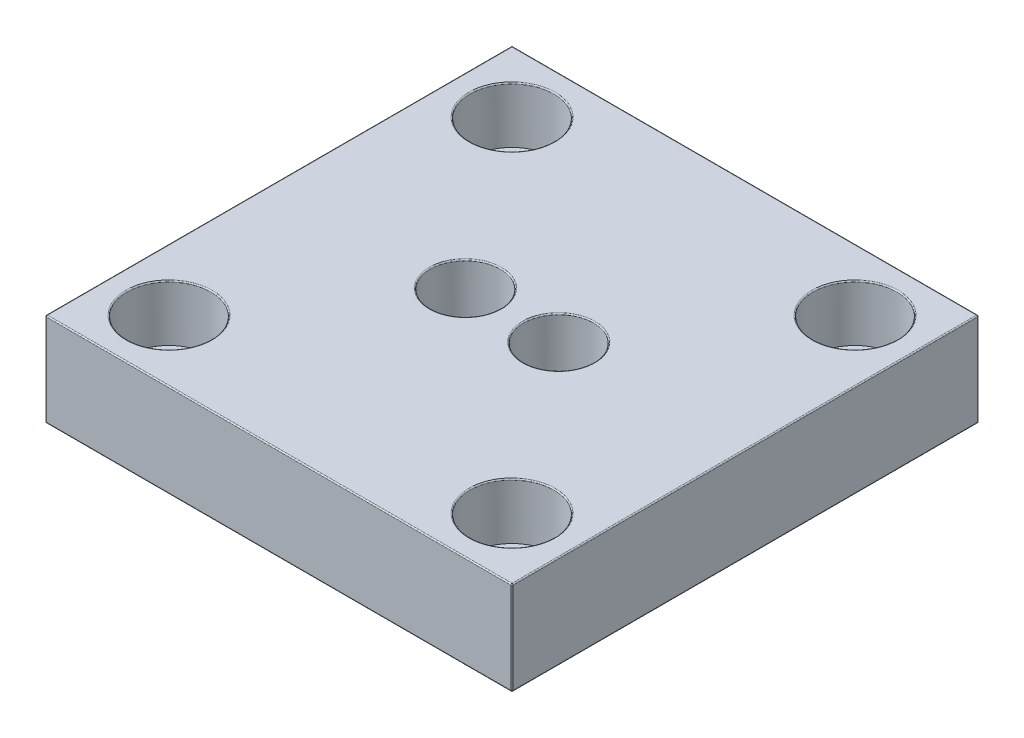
ISO-10303-21;
HEADER;
FILE_DESCRIPTION(('STEP AP214'),'2;1');
FILE_NAME('part.step','',(''),(''),'','','');
FILE_SCHEMA(('AUTOMOTIVE_DESIGN { 1 0 10303 214 1 1 1 1 }'));
ENDSEC;
DATA;
#1=APPLICATION_CONTEXT('core data for automotive mechanical design processes');
#2=APPLICATION_PROTOCOL_DEFINITION('international standard','automotive_design',2000,#1);
#3=PRODUCT_CONTEXT('',#1,'mechanical');
#4=PRODUCT('Part','Part','',(#3));
#5=PRODUCT_RELATED_PRODUCT_CATEGORY('part','',(#4));
#6=PRODUCT_DEFINITION_FORMATION('','',#4);
#7=PRODUCT_DEFINITION_CONTEXT('part definition',#1,'design');
#8=PRODUCT_DEFINITION('design','',#6,#7);
#9=PRODUCT_DEFINITION_SHAPE('','',#8);
#10=(LENGTH_UNIT() NAMED_UNIT(*) SI_UNIT(.MILLI.,.METRE.));
#11=(NAMED_UNIT(*) PLANE_ANGLE_UNIT() SI_UNIT($,.RADIAN.));
#12=(NAMED_UNIT(*) SI_UNIT($,.STERADIAN.) SOLID_ANGLE_UNIT());
#13=UNCERTAINTY_MEASURE_WITH_UNIT(LENGTH_MEASURE(1.E-05),#10,'distance_accuracy_value','');
#14=(GEOMETRIC_REPRESENTATION_CONTEXT(3) GLOBAL_UNCERTAINTY_ASSIGNED_CONTEXT((#13)) GLOBAL_UNIT_ASSIGNED_CONTEXT((#10,
#11,#12)) REPRESENTATION_CONTEXT('',''));
#15=CARTESIAN_POINT('',(0.,0.,0.));
#16=DIRECTION('',(0.,0.,1.));
#17=DIRECTION('',(1.,0.,0.));
#18=AXIS2_PLACEMENT_3D('',#15,#16,#17);
#19=CARTESIAN_POINT('',(86.75,0.,-13.25));
#20=DIRECTION('',(0.,1.,0.));
#21=DIRECTION('',(0.,0.,1.));
#22=AXIS2_PLACEMENT_3D('',#19,#20,#21);
#23=CYLINDRICAL_SURFACE('',#22,5.25);
#24=CARTESIAN_POINT('',(86.75,0.25,-13.25));
#25=DIRECTION('',(0.,-1.,0.));
#26=DIRECTION('',(0.,0.,-1.));
#27=AXIS2_PLACEMENT_3D('',#24,#25,#26);
#28=CIRCLE('',#27,5.25);
#29=CARTESIAN_POINT('',(86.75,0.25,-18.5));
#30=VERTEX_POINT('',#29);
#31=EDGE_CURVE('E226',#30,#30,#28,.T.);
#32=ORIENTED_EDGE('',*,*,#31,.T.);
#33=EDGE_LOOP('',(#32));
#34=FACE_BOUND('',#33,.T.);
#35=CARTESIAN_POINT('',(86.75,8.,-13.25));
#36=DIRECTION('',(0.,1.,0.));
#37=DIRECTION('',(0.,0.,1.));
#38=AXIS2_PLACEMENT_3D('',#35,#36,#37);
#39=CIRCLE('',#38,5.25);
#40=CARTESIAN_POINT('',(86.75,8.,-7.99999999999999));
#41=VERTEX_POINT('',#40);
#42=EDGE_CURVE('E182',#41,#41,#39,.F.);
#43=ORIENTED_EDGE('',*,*,#42,.F.);
#44=EDGE_LOOP('',(#43));
#45=FACE_BOUND('',#44,.T.);
#46=ADVANCED_FACE('F43',(#34,#45),#23,.F.);
#47=CARTESIAN_POINT('',(13.25,0.,-13.25));
#48=DIRECTION('',(0.,1.,0.));
#49=DIRECTION('',(0.,0.,1.));
#50=AXIS2_PLACEMENT_3D('',#47,#48,#49);
#51=CYLINDRICAL_SURFACE('',#50,5.25);
#52=CARTESIAN_POINT('',(13.25,0.25,-13.25));
#53=DIRECTION('',(0.,-1.,0.));
#54=DIRECTION('',(0.,0.,-1.));
#55=AXIS2_PLACEMENT_3D('',#52,#53,#54);
#56=CIRCLE('',#55,5.25);
#57=CARTESIAN_POINT('',(13.25,0.25,-18.5));
#58=VERTEX_POINT('',#57);
#59=EDGE_CURVE('E222',#58,#58,#56,.T.);
#60=ORIENTED_EDGE('',*,*,#59,.T.);
#61=EDGE_LOOP('',(#60));
#62=FACE_BOUND('',#61,.T.);
#63=CARTESIAN_POINT('',(13.25,8.,-13.25));
#64=DIRECTION('',(0.,1.,0.));
#65=DIRECTION('',(0.,0.,1.));
#66=AXIS2_PLACEMENT_3D('',#63,#64,#65);
#67=CIRCLE('',#66,5.25);
#68=CARTESIAN_POINT('',(13.25,8.,-8.));
#69=VERTEX_POINT('',#68);
#70=EDGE_CURVE('E433',#69,#69,#67,.F.);
#71=ORIENTED_EDGE('',*,*,#70,.F.);
#72=EDGE_LOOP('',(#71));
#73=FACE_BOUND('',#72,.T.);
#74=ADVANCED_FACE('F465',(#62,#73),#51,.F.);
#75=CARTESIAN_POINT('',(13.25,0.,-86.75));
#76=DIRECTION('',(0.,1.,0.));
#77=DIRECTION('',(0.,0.,1.));
#78=AXIS2_PLACEMENT_3D('',#75,#76,#77);
#79=CYLINDRICAL_SURFACE('',#78,5.25);
#80=CARTESIAN_POINT('',(13.25,0.25,-86.75));
#81=DIRECTION('',(0.,-1.,0.));
#82=DIRECTION('',(0.,0.,-1.));
#83=AXIS2_PLACEMENT_3D('',#80,#81,#82);
#84=CIRCLE('',#83,5.25);
#85=CARTESIAN_POINT('',(13.25,0.25,-92.));
#86=VERTEX_POINT('',#85);
#87=EDGE_CURVE('E218',#86,#86,#84,.T.);
#88=ORIENTED_EDGE('',*,*,#87,.T.);
#89=EDGE_LOOP('',(#88));
#90=FACE_BOUND('',#89,.T.);
#91=CARTESIAN_POINT('',(13.25,8.,-86.75));
#92=DIRECTION('',(0.,1.,0.));
#93=DIRECTION('',(0.,0.,1.));
#94=AXIS2_PLACEMENT_3D('',#91,#92,#93);
#95=CIRCLE('',#94,5.25);
#96=CARTESIAN_POINT('',(13.25,8.,-81.5));
#97=VERTEX_POINT('',#96);
#98=EDGE_CURVE('E438',#97,#97,#95,.F.);
#99=ORIENTED_EDGE('',*,*,#98,.F.);
#100=EDGE_LOOP('',(#99));
#101=FACE_BOUND('',#100,.T.);
#102=ADVANCED_FACE('F467',(#90,#101),#79,.F.);
#103=CARTESIAN_POINT('',(86.75,0.,-86.75));
#104=DIRECTION('',(0.,1.,0.));
#105=DIRECTION('',(0.,0.,1.));
#106=AXIS2_PLACEMENT_3D('',#103,#104,#105);
#107=CYLINDRICAL_SURFACE('',#106,5.25);
#108=CARTESIAN_POINT('',(86.75,0.25,-86.75));
#109=DIRECTION('',(0.,-1.,0.));
#110=DIRECTION('',(0.,0.,-1.));
#111=AXIS2_PLACEMENT_3D('',#108,#109,#110);
#112=CIRCLE('',#111,5.25);
#113=CARTESIAN_POINT('',(86.75,0.25,-92.));
#114=VERTEX_POINT('',#113);
#115=EDGE_CURVE('E234',#114,#114,#112,.T.);
#116=ORIENTED_EDGE('',*,*,#115,.T.);
#117=EDGE_LOOP('',(#116));
#118=FACE_BOUND('',#117,.T.);
#119=CARTESIAN_POINT('',(86.75,8.,-86.75));
#120=DIRECTION('',(0.,1.,0.));
#121=DIRECTION('',(0.,0.,1.));
#122=AXIS2_PLACEMENT_3D('',#119,#120,#121);
#123=CIRCLE('',#122,5.25);
#124=CARTESIAN_POINT('',(86.75,8.,-81.5));
#125=VERTEX_POINT('',#124);
#126=EDGE_CURVE('E442',#125,#125,#123,.F.);
#127=ORIENTED_EDGE('',*,*,#126,.F.);
#128=EDGE_LOOP('',(#127));
#129=FACE_BOUND('',#128,.T.);
#130=ADVANCED_FACE('F474',(#118,#129),#107,.F.);
#131=CARTESIAN_POINT('',(60.,0.,-50.));
#132=DIRECTION('',(0.,1.,0.));
#133=DIRECTION('',(0.,0.,1.));
#134=AXIS2_PLACEMENT_3D('',#131,#132,#133);
#135=CYLINDRICAL_SURFACE('',#134,4.50000000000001);
#136=CARTESIAN_POINT('',(60.,0.25,-50.));
#137=DIRECTION('',(0.,-1.,0.));
#138=DIRECTION('',(0.,0.,-1.));
#139=AXIS2_PLACEMENT_3D('',#136,#137,#138);
#140=CIRCLE('',#139,4.50000000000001);
#141=CARTESIAN_POINT('',(60.,0.25,-54.5));
#142=VERTEX_POINT('',#141);
#143=EDGE_CURVE('E230',#142,#142,#140,.T.);
#144=ORIENTED_EDGE('',*,*,#143,.T.);
#145=EDGE_LOOP('',(#144));
#146=FACE_BOUND('',#145,.T.);
#147=CARTESIAN_POINT('',(60.,8.,-50.));
#148=DIRECTION('',(0.,1.,0.));
#149=DIRECTION('',(0.,0.,1.));
#150=AXIS2_PLACEMENT_3D('',#147,#148,#149);
#151=CIRCLE('',#150,4.50000000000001);
#152=CARTESIAN_POINT('',(60.,8.,-45.5));
#153=VERTEX_POINT('',#152);
#154=EDGE_CURVE('E447',#153,#153,#151,.F.);
#155=ORIENTED_EDGE('',*,*,#154,.F.);
#156=EDGE_LOOP('',(#155));
#157=FACE_BOUND('',#156,.T.);
#158=ADVANCED_FACE('F485',(#146,#157),#135,.F.);
#159=CARTESIAN_POINT('',(40.,0.,-50.));
#160=DIRECTION('',(0.,1.,0.));
#161=DIRECTION('',(0.,0.,1.));
#162=AXIS2_PLACEMENT_3D('',#159,#160,#161);
#163=CYLINDRICAL_SURFACE('',#162,4.50000000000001);
#164=CARTESIAN_POINT('',(40.,0.25,-50.));
#165=DIRECTION('',(0.,-1.,0.));
#166=DIRECTION('',(0.,0.,-1.));
#167=AXIS2_PLACEMENT_3D('',#164,#165,#166);
#168=CIRCLE('',#167,4.50000000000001);
#169=CARTESIAN_POINT('',(40.,0.25,-54.5));
#170=VERTEX_POINT('',#169);
#171=EDGE_CURVE('E214',#170,#170,#168,.T.);
#172=ORIENTED_EDGE('',*,*,#171,.T.);
#173=EDGE_LOOP('',(#172));
#174=FACE_BOUND('',#173,.T.);
#175=CARTESIAN_POINT('',(40.,8.,-50.));
#176=DIRECTION('',(0.,1.,0.));
#177=DIRECTION('',(0.,0.,1.));
#178=AXIS2_PLACEMENT_3D('',#175,#176,#177);
#179=CIRCLE('',#178,4.50000000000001);
#180=CARTESIAN_POINT('',(40.,8.,-45.5));
#181=VERTEX_POINT('',#180);
#182=EDGE_CURVE('E173',#181,#181,#179,.F.);
#183=ORIENTED_EDGE('',*,*,#182,.F.);
#184=EDGE_LOOP('',(#183));
#185=FACE_BOUND('',#184,.T.);
#186=ADVANCED_FACE('F481',(#174,#185),#163,.F.);
#187=CARTESIAN_POINT('',(0.,20.,0.));
#188=DIRECTION('',(1.,0.,0.));
#189=DIRECTION('',(0.,0.,-1.));
#190=AXIS2_PLACEMENT_3D('',#187,#188,#189);
#191=PLANE('',#190);
#192=DIRECTION('',(0.,-1.,0.));
#193=VECTOR('',#192,1.);
#194=CARTESIAN_POINT('',(0.,20.,-99.75));
#195=LINE('',#194,#193);
#196=CARTESIAN_POINT('',(0.,19.75,-99.75));
#197=VERTEX_POINT('',#196);
#198=CARTESIAN_POINT('',(0.,0.25,-99.75));
#199=VERTEX_POINT('',#198);
#200=EDGE_CURVE('E244',#197,#199,#195,.T.);
#201=ORIENTED_EDGE('',*,*,#200,.T.);
#202=DIRECTION('',(0.,0.,1.));
#203=VECTOR('',#202,1.);
#204=CARTESIAN_POINT('',(0.,0.25,0.));
#205=LINE('',#204,#203);
#206=CARTESIAN_POINT('',(0.,0.25,-0.25));
#207=VERTEX_POINT('',#206);
#208=EDGE_CURVE('E247',#199,#207,#205,.T.);
#209=ORIENTED_EDGE('',*,*,#208,.T.);
#210=DIRECTION('',(0.,-1.,0.));
#211=VECTOR('',#210,1.);
#212=CARTESIAN_POINT('',(0.,20.,-0.25));
#213=LINE('',#212,#211);
#214=CARTESIAN_POINT('',(0.,19.75,-0.25));
#215=VERTEX_POINT('',#214);
#216=EDGE_CURVE('E241',#207,#215,#213,.F.);
#217=ORIENTED_EDGE('',*,*,#216,.T.);
#218=DIRECTION('',(0.,0.,1.));
#219=VECTOR('',#218,1.);
#220=CARTESIAN_POINT('',(0.,19.75,0.));
#221=LINE('',#220,#219);
#222=EDGE_CURVE('E238',#215,#197,#221,.F.);
#223=ORIENTED_EDGE('',*,*,#222,.T.);
#224=EDGE_LOOP('',(#201,#209,#217,#223));
#225=FACE_BOUND('',#224,.T.);
#226=ADVANCED_FACE('F484',(#225),#191,.F.);
#227=CARTESIAN_POINT('',(0.,20.,0.));
#228=DIRECTION('',(0.,0.,-1.));
#229=DIRECTION('',(-1.,0.,0.));
#230=AXIS2_PLACEMENT_3D('',#227,#228,#229);
#231=PLANE('',#230);
#232=DIRECTION('',(0.,-1.,0.));
#233=VECTOR('',#232,1.);
#234=CARTESIAN_POINT('',(0.25,20.,0.));
#235=LINE('',#234,#233);
#236=CARTESIAN_POINT('',(0.25,19.75,0.));
#237=VERTEX_POINT('',#236);
#238=CARTESIAN_POINT('',(0.25,0.25,0.));
#239=VERTEX_POINT('',#238);
#240=EDGE_CURVE('E282',#237,#239,#235,.T.);
#241=ORIENTED_EDGE('',*,*,#240,.T.);
#242=DIRECTION('',(1.,0.,0.));
#243=VECTOR('',#242,1.);
#244=CARTESIAN_POINT('',(100.,0.25,0.));
#245=LINE('',#244,#243);
#246=CARTESIAN_POINT('',(99.75,0.25,0.));
#247=VERTEX_POINT('',#246);
#248=EDGE_CURVE('E286',#239,#247,#245,.T.);
#249=ORIENTED_EDGE('',*,*,#248,.T.);
#250=DIRECTION('',(0.,-1.,0.));
#251=VECTOR('',#250,1.);
#252=CARTESIAN_POINT('',(99.75,20.,0.));
#253=LINE('',#252,#251);
#254=CARTESIAN_POINT('',(99.75,19.75,0.));
#255=VERTEX_POINT('',#254);
#256=EDGE_CURVE('E279',#247,#255,#253,.F.);
#257=ORIENTED_EDGE('',*,*,#256,.T.);
#258=DIRECTION('',(1.,0.,0.));
#259=VECTOR('',#258,1.);
#260=CARTESIAN_POINT('',(0.,19.75,0.));
#261=LINE('',#260,#259);
#262=EDGE_CURVE('E276',#255,#237,#261,.F.);
#263=ORIENTED_EDGE('',*,*,#262,.T.);
#264=EDGE_LOOP('',(#241,#249,#257,#263));
#265=FACE_BOUND('',#264,.T.);
#266=ADVANCED_FACE('F501',(#265),#231,.F.);
#267=CARTESIAN_POINT('',(100.,20.,0.));
#268=DIRECTION('',(-1.,0.,0.));
#269=DIRECTION('',(0.,0.,1.));
#270=AXIS2_PLACEMENT_3D('',#267,#268,#269);
#271=PLANE('',#270);
#272=DIRECTION('',(0.,0.,-1.));
#273=VECTOR('',#272,1.);
#274=CARTESIAN_POINT('',(100.,0.25,-100.));
#275=LINE('',#274,#273);
#276=CARTESIAN_POINT('',(100.,0.25,-0.25));
#277=VERTEX_POINT('',#276);
#278=CARTESIAN_POINT('',(100.,0.25,-99.75));
#279=VERTEX_POINT('',#278);
#280=EDGE_CURVE('E152',#277,#279,#275,.T.);
#281=ORIENTED_EDGE('',*,*,#280,.T.);
#282=DIRECTION('',(0.,-1.,0.));
#283=VECTOR('',#282,1.);
#284=CARTESIAN_POINT('',(100.,20.,-99.75));
#285=LINE('',#284,#283);
#286=CARTESIAN_POINT('',(100.,19.75,-99.75));
#287=VERTEX_POINT('',#286);
#288=EDGE_CURVE('E272',#279,#287,#285,.F.);
#289=ORIENTED_EDGE('',*,*,#288,.T.);
#290=DIRECTION('',(0.,0.,-1.));
#291=VECTOR('',#290,1.);
#292=CARTESIAN_POINT('',(100.,19.75,0.));
#293=LINE('',#292,#291);
#294=CARTESIAN_POINT('',(100.,19.75,-0.25));
#295=VERTEX_POINT('',#294);
#296=EDGE_CURVE('E264',#287,#295,#293,.F.);
#297=ORIENTED_EDGE('',*,*,#296,.T.);
#298=DIRECTION('',(0.,-1.,0.));
#299=VECTOR('',#298,1.);
#300=CARTESIAN_POINT('',(100.,20.,-0.25));
#301=LINE('',#300,#299);
#302=EDGE_CURVE('E267',#295,#277,#301,.T.);
#303=ORIENTED_EDGE('',*,*,#302,.T.);
#304=EDGE_LOOP('',(#281,#289,#297,#303));
#305=FACE_BOUND('',#304,.T.);
#306=ADVANCED_FACE('F497',(#305),#271,.F.);
#307=CARTESIAN_POINT('',(0.,20.,-100.));
#308=DIRECTION('',(0.,0.,1.));
#309=DIRECTION('',(1.,0.,0.));
#310=AXIS2_PLACEMENT_3D('',#307,#308,#309);
#311=PLANE('',#310);
#312=DIRECTION('',(-1.,0.,0.));
#313=VECTOR('',#312,1.);
#314=CARTESIAN_POINT('',(0.,0.25,-100.));
#315=LINE('',#314,#313);
#316=CARTESIAN_POINT('',(99.75,0.25,-100.));
#317=VERTEX_POINT('',#316);
#318=CARTESIAN_POINT('',(0.25,0.25,-100.));
#319=VERTEX_POINT('',#318);
#320=EDGE_CURVE('E257',#317,#319,#315,.T.);
#321=ORIENTED_EDGE('',*,*,#320,.T.);
#322=DIRECTION('',(0.,-1.,0.));
#323=VECTOR('',#322,1.);
#324=CARTESIAN_POINT('',(0.25,20.,-100.));
#325=LINE('',#324,#323);
#326=CARTESIAN_POINT('',(0.25,19.75,-100.));
#327=VERTEX_POINT('',#326);
#328=EDGE_CURVE('E260',#319,#327,#325,.F.);
#329=ORIENTED_EDGE('',*,*,#328,.T.);
#330=DIRECTION('',(-1.,0.,0.));
#331=VECTOR('',#330,1.);
#332=CARTESIAN_POINT('',(0.,19.75,-100.));
#333=LINE('',#332,#331);
#334=CARTESIAN_POINT('',(99.75,19.75,-100.));
#335=VERTEX_POINT('',#334);
#336=EDGE_CURVE('E251',#327,#335,#333,.F.);
#337=ORIENTED_EDGE('',*,*,#336,.T.);
#338=DIRECTION('',(0.,-1.,0.));
#339=VECTOR('',#338,1.);
#340=CARTESIAN_POINT('',(99.75,20.,-100.));
#341=LINE('',#340,#339);
#342=EDGE_CURVE('E254',#335,#317,#341,.T.);
#343=ORIENTED_EDGE('',*,*,#342,.T.);
#344=EDGE_LOOP('',(#321,#329,#337,#343));
#345=FACE_BOUND('',#344,.T.);
#346=ADVANCED_FACE('F490',(#345),#311,.F.);
#347=CARTESIAN_POINT('',(0.,20.,-100.));
#348=DIRECTION('',(0.,-1.,0.));
#349=DIRECTION('',(0.,0.,-1.));
#350=AXIS2_PLACEMENT_3D('',#347,#348,#349);
#351=PLANE('',#350);
#352=DIRECTION('',(0.,0.,-1.));
#353=VECTOR('',#352,1.);
#354=CARTESIAN_POINT('',(99.75,20.,-100.));
#355=LINE('',#354,#353);
#356=CARTESIAN_POINT('',(99.75,20.,-0.25));
#357=VERTEX_POINT('',#356);
#358=CARTESIAN_POINT('',(99.75,20.,-99.75));
#359=VERTEX_POINT('',#358);
#360=EDGE_CURVE('E61',#357,#359,#355,.T.);
#361=ORIENTED_EDGE('',*,*,#360,.T.);
#362=DIRECTION('',(-1.,0.,0.));
#363=VECTOR('',#362,1.);
#364=CARTESIAN_POINT('',(0.,20.,-99.75));
#365=LINE('',#364,#363);
#366=CARTESIAN_POINT('',(0.25,20.,-99.75));
#367=VERTEX_POINT('',#366);
#368=EDGE_CURVE('E320',#359,#367,#365,.T.);
#369=ORIENTED_EDGE('',*,*,#368,.T.);
#370=DIRECTION('',(0.,0.,1.));
#371=VECTOR('',#370,1.);
#372=CARTESIAN_POINT('',(0.25,20.,-100.));
#373=LINE('',#372,#371);
#374=CARTESIAN_POINT('',(0.25,20.,-0.25));
#375=VERTEX_POINT('',#374);
#376=EDGE_CURVE('E313',#367,#375,#373,.T.);
#377=ORIENTED_EDGE('',*,*,#376,.T.);
#378=DIRECTION('',(1.,0.,0.));
#379=VECTOR('',#378,1.);
#380=CARTESIAN_POINT('',(0.,20.,-0.25));
#381=LINE('',#380,#379);
#382=EDGE_CURVE('E66',#375,#357,#381,.T.);
#383=ORIENTED_EDGE('',*,*,#382,.T.);
#384=EDGE_LOOP('',(#361,#369,#377,#383));
#385=FACE_BOUND('',#384,.T.);
#386=CARTESIAN_POINT('',(40.,20.,-50.));
#387=DIRECTION('',(0.,-1.,0.));
#388=DIRECTION('',(0.,0.,-1.));
#389=AXIS2_PLACEMENT_3D('',#386,#387,#388);
#390=CIRCLE('',#389,7.75);
#391=CARTESIAN_POINT('',(40.,20.,-57.75));
#392=VERTEX_POINT('',#391);
#393=EDGE_CURVE('E309',#392,#392,#390,.T.);
#394=ORIENTED_EDGE('',*,*,#393,.T.);
#395=EDGE_LOOP('',(#394));
#396=FACE_BOUND('',#395,.T.);
#397=CARTESIAN_POINT('',(60.,20.,-50.));
#398=DIRECTION('',(0.,-1.,0.));
#399=DIRECTION('',(0.,0.,-1.));
#400=AXIS2_PLACEMENT_3D('',#397,#398,#399);
#401=CIRCLE('',#400,7.75);
#402=CARTESIAN_POINT('',(60.,20.,-57.75));
#403=VERTEX_POINT('',#402);
#404=EDGE_CURVE('E305',#403,#403,#401,.T.);
#405=ORIENTED_EDGE('',*,*,#404,.T.);
#406=EDGE_LOOP('',(#405));
#407=FACE_BOUND('',#406,.T.);
#408=CARTESIAN_POINT('',(86.75,20.,-86.75));
#409=DIRECTION('',(0.,-1.,0.));
#410=DIRECTION('',(0.,0.,-1.));
#411=AXIS2_PLACEMENT_3D('',#408,#409,#410);
#412=CIRCLE('',#411,9.24999999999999);
#413=CARTESIAN_POINT('',(86.75,20.,-96.));
#414=VERTEX_POINT('',#413);
#415=EDGE_CURVE('E301',#414,#414,#412,.T.);
#416=ORIENTED_EDGE('',*,*,#415,.T.);
#417=EDGE_LOOP('',(#416));
#418=FACE_BOUND('',#417,.T.);
#419=CARTESIAN_POINT('',(13.25,20.,-86.75));
#420=DIRECTION('',(0.,-1.,0.));
#421=DIRECTION('',(0.,0.,-1.));
#422=AXIS2_PLACEMENT_3D('',#419,#420,#421);
#423=CIRCLE('',#422,9.25000000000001);
#424=CARTESIAN_POINT('',(13.25,20.,-96.));
#425=VERTEX_POINT('',#424);
#426=EDGE_CURVE('E297',#425,#425,#423,.T.);
#427=ORIENTED_EDGE('',*,*,#426,.T.);
#428=EDGE_LOOP('',(#427));
#429=FACE_BOUND('',#428,.T.);
#430=CARTESIAN_POINT('',(13.25,20.,-13.25));
#431=DIRECTION('',(0.,-1.,0.));
#432=DIRECTION('',(0.,0.,-1.));
#433=AXIS2_PLACEMENT_3D('',#430,#431,#432);
#434=CIRCLE('',#433,9.25);
#435=CARTESIAN_POINT('',(13.25,20.,-22.5));
#436=VERTEX_POINT('',#435);
#437=EDGE_CURVE('E293',#436,#436,#434,.T.);
#438=ORIENTED_EDGE('',*,*,#437,.T.);
#439=EDGE_LOOP('',(#438));
#440=FACE_BOUND('',#439,.T.);
#441=CARTESIAN_POINT('',(86.75,20.,-13.25));
#442=DIRECTION('',(0.,-1.,0.));
#443=DIRECTION('',(0.,0.,-1.));
#444=AXIS2_PLACEMENT_3D('',#441,#442,#443);
#445=CIRCLE('',#444,9.25);
#446=CARTESIAN_POINT('',(86.75,20.,-22.5));
#447=VERTEX_POINT('',#446);
#448=EDGE_CURVE('E289',#447,#447,#445,.T.);
#449=ORIENTED_EDGE('',*,*,#448,.T.);
#450=EDGE_LOOP('',(#449));
#451=FACE_BOUND('',#450,.T.);
#452=ADVANCED_FACE('F487',(#385,#396,#407,#418,#429,#440,#451),#351,.F.);
#453=CARTESIAN_POINT('',(0.,0.,-100.));
#454=DIRECTION('',(0.,-1.,0.));
#455=DIRECTION('',(0.,0.,-1.));
#456=AXIS2_PLACEMENT_3D('',#453,#454,#455);
#457=PLANE('',#456);
#458=CARTESIAN_POINT('',(40.,0.,-50.));
#459=DIRECTION('',(0.,-1.,0.));
#460=DIRECTION('',(0.,0.,-1.));
#461=AXIS2_PLACEMENT_3D('',#458,#459,#460);
#462=CIRCLE('',#461,4.75000000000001);
#463=CARTESIAN_POINT('',(40.,0.,-54.75));
#464=VERTEX_POINT('',#463);
#465=EDGE_CURVE('E210',#464,#464,#462,.F.);
#466=ORIENTED_EDGE('',*,*,#465,.T.);
#467=EDGE_LOOP('',(#466));
#468=FACE_BOUND('',#467,.T.);
#469=CARTESIAN_POINT('',(13.25,0.,-86.75));
#470=DIRECTION('',(0.,-1.,0.));
#471=DIRECTION('',(0.,0.,-1.));
#472=AXIS2_PLACEMENT_3D('',#469,#470,#471);
#473=CIRCLE('',#472,5.5);
#474=CARTESIAN_POINT('',(13.25,0.,-92.25));
#475=VERTEX_POINT('',#474);
#476=EDGE_CURVE('E206',#475,#475,#473,.F.);
#477=ORIENTED_EDGE('',*,*,#476,.T.);
#478=EDGE_LOOP('',(#477));
#479=FACE_BOUND('',#478,.T.);
#480=CARTESIAN_POINT('',(13.25,0.,-13.25));
#481=DIRECTION('',(0.,-1.,0.));
#482=DIRECTION('',(0.,0.,-1.));
#483=AXIS2_PLACEMENT_3D('',#480,#481,#482);
#484=CIRCLE('',#483,5.5);
#485=CARTESIAN_POINT('',(13.25,0.,-18.75));
#486=VERTEX_POINT('',#485);
#487=EDGE_CURVE('E202',#486,#486,#484,.F.);
#488=ORIENTED_EDGE('',*,*,#487,.T.);
#489=EDGE_LOOP('',(#488));
#490=FACE_BOUND('',#489,.T.);
#491=CARTESIAN_POINT('',(86.75,0.,-13.25));
#492=DIRECTION('',(0.,-1.,0.));
#493=DIRECTION('',(0.,0.,-1.));
#494=AXIS2_PLACEMENT_3D('',#491,#492,#493);
#495=CIRCLE('',#494,5.5);
#496=CARTESIAN_POINT('',(86.75,0.,-18.75));
#497=VERTEX_POINT('',#496);
#498=EDGE_CURVE('E198',#497,#497,#495,.F.);
#499=ORIENTED_EDGE('',*,*,#498,.T.);
#500=EDGE_LOOP('',(#499));
#501=FACE_BOUND('',#500,.T.);
#502=CARTESIAN_POINT('',(60.,0.,-50.));
#503=DIRECTION('',(0.,-1.,0.));
#504=DIRECTION('',(0.,0.,-1.));
#505=AXIS2_PLACEMENT_3D('',#502,#503,#504);
#506=CIRCLE('',#505,4.75000000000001);
#507=CARTESIAN_POINT('',(60.,0.,-54.75));
#508=VERTEX_POINT('',#507);
#509=EDGE_CURVE('E194',#508,#508,#506,.F.);
#510=ORIENTED_EDGE('',*,*,#509,.T.);
#511=EDGE_LOOP('',(#510));
#512=FACE_BOUND('',#511,.T.);
#513=CARTESIAN_POINT('',(86.75,0.,-86.75));
#514=DIRECTION('',(0.,-1.,0.));
#515=DIRECTION('',(0.,0.,-1.));
#516=AXIS2_PLACEMENT_3D('',#513,#514,#515);
#517=CIRCLE('',#516,5.50000000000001);
#518=CARTESIAN_POINT('',(86.75,0.,-92.25));
#519=VERTEX_POINT('',#518);
#520=EDGE_CURVE('E190',#519,#519,#517,.F.);
#521=ORIENTED_EDGE('',*,*,#520,.T.);
#522=EDGE_LOOP('',(#521));
#523=FACE_BOUND('',#522,.T.);
#524=DIRECTION('',(1.,0.,0.));
#525=VECTOR('',#524,1.);
#526=CARTESIAN_POINT('',(0.,0.,-0.25));
#527=LINE('',#526,#525);
#528=CARTESIAN_POINT('',(99.75,0.,-0.25));
#529=VERTEX_POINT('',#528);
#530=CARTESIAN_POINT('',(0.25,0.,-0.25));
#531=VERTEX_POINT('',#530);
#532=EDGE_CURVE('E138',#529,#531,#527,.F.);
#533=ORIENTED_EDGE('',*,*,#532,.T.);
#534=DIRECTION('',(0.,0.,1.));
#535=VECTOR('',#534,1.);
#536=CARTESIAN_POINT('',(0.25,0.,-100.));
#537=LINE('',#536,#535);
#538=CARTESIAN_POINT('',(0.25,0.,-99.75));
#539=VERTEX_POINT('',#538);
#540=EDGE_CURVE('E187',#531,#539,#537,.F.);
#541=ORIENTED_EDGE('',*,*,#540,.T.);
#542=DIRECTION('',(-1.,0.,0.));
#543=VECTOR('',#542,1.);
#544=CARTESIAN_POINT('',(100.,0.,-99.75));
#545=LINE('',#544,#543);
#546=CARTESIAN_POINT('',(99.75,0.,-99.75));
#547=VERTEX_POINT('',#546);
#548=EDGE_CURVE('E141',#539,#547,#545,.F.);
#549=ORIENTED_EDGE('',*,*,#548,.T.);
#550=DIRECTION('',(0.,0.,-1.));
#551=VECTOR('',#550,1.);
#552=CARTESIAN_POINT('',(99.75,0.,0.));
#553=LINE('',#552,#551);
#554=EDGE_CURVE('E133',#547,#529,#553,.F.);
#555=ORIENTED_EDGE('',*,*,#554,.T.);
#556=EDGE_LOOP('',(#533,#541,#549,#555));
#557=FACE_BOUND('',#556,.T.);
#558=ADVANCED_FACE('F135',(#468,#479,#490,#501,#512,#523,#557),#457,.T.);
#559=CARTESIAN_POINT('',(40.,8.,-50.));
#560=DIRECTION('',(0.,1.,0.));
#561=DIRECTION('',(0.,0.,1.));
#562=AXIS2_PLACEMENT_3D('',#559,#560,#561);
#563=PLANE('',#562);
#564=CARTESIAN_POINT('',(40.,8.,-50.));
#565=DIRECTION('',(0.,1.,0.));
#566=DIRECTION('',(0.,0.,1.));
#567=AXIS2_PLACEMENT_3D('',#564,#565,#566);
#568=CIRCLE('',#567,7.5);
#569=CARTESIAN_POINT('',(40.,8.,-42.5));
#570=VERTEX_POINT('',#569);
#571=EDGE_CURVE('E179',#570,#570,#568,.T.);
#572=ORIENTED_EDGE('',*,*,#571,.T.);
#573=EDGE_LOOP('',(#572));
#574=FACE_BOUND('',#573,.T.);
#575=ORIENTED_EDGE('',*,*,#182,.T.);
#576=EDGE_LOOP('',(#575));
#577=FACE_BOUND('',#576,.T.);
#578=ADVANCED_FACE('F493',(#574,#577),#563,.T.);
#579=CARTESIAN_POINT('',(40.,8.,-50.));
#580=DIRECTION('',(0.,1.,0.));
#581=DIRECTION('',(0.,0.,1.));
#582=AXIS2_PLACEMENT_3D('',#579,#580,#581);
#583=CYLINDRICAL_SURFACE('',#582,7.5);
#584=CARTESIAN_POINT('',(40.,19.75,-50.));
#585=DIRECTION('',(0.,-1.,0.));
#586=DIRECTION('',(0.,0.,-1.));
#587=AXIS2_PLACEMENT_3D('',#584,#585,#586);
#588=CIRCLE('',#587,7.5);
#589=CARTESIAN_POINT('',(40.,19.75,-57.5));
#590=VERTEX_POINT('',#589);
#591=EDGE_CURVE('E322',#590,#590,#588,.F.);
#592=ORIENTED_EDGE('',*,*,#591,.T.);
#593=EDGE_LOOP('',(#592));
#594=FACE_BOUND('',#593,.T.);
#595=ORIENTED_EDGE('',*,*,#571,.F.);
#596=EDGE_LOOP('',(#595));
#597=FACE_BOUND('',#596,.T.);
#598=ADVANCED_FACE('F666',(#594,#597),#583,.F.);
#599=CARTESIAN_POINT('',(60.,8.,-50.));
#600=DIRECTION('',(0.,1.,0.));
#601=DIRECTION('',(0.,0.,1.));
#602=AXIS2_PLACEMENT_3D('',#599,#600,#601);
#603=PLANE('',#602);
#604=CARTESIAN_POINT('',(60.,8.,-50.));
#605=DIRECTION('',(0.,1.,0.));
#606=DIRECTION('',(0.,0.,1.));
#607=AXIS2_PLACEMENT_3D('',#604,#605,#606);
#608=CIRCLE('',#607,7.5);
#609=CARTESIAN_POINT('',(60.,8.,-42.5));
#610=VERTEX_POINT('',#609);
#611=EDGE_CURVE('E443',#610,#610,#608,.T.);
#612=ORIENTED_EDGE('',*,*,#611,.T.);
#613=EDGE_LOOP('',(#612));
#614=FACE_BOUND('',#613,.T.);
#615=ORIENTED_EDGE('',*,*,#154,.T.);
#616=EDGE_LOOP('',(#615));
#617=FACE_BOUND('',#616,.T.);
#618=ADVANCED_FACE('F663',(#614,#617),#603,.T.);
#619=CARTESIAN_POINT('',(60.,8.,-50.));
#620=DIRECTION('',(0.,1.,0.));
#621=DIRECTION('',(0.,0.,1.));
#622=AXIS2_PLACEMENT_3D('',#619,#620,#621);
#623=CYLINDRICAL_SURFACE('',#622,7.5);
#624=CARTESIAN_POINT('',(60.,19.75,-50.));
#625=DIRECTION('',(0.,-1.,0.));
#626=DIRECTION('',(0.,0.,-1.));
#627=AXIS2_PLACEMENT_3D('',#624,#625,#626);
#628=CIRCLE('',#627,7.5);
#629=CARTESIAN_POINT('',(60.,19.75,-57.5));
#630=VERTEX_POINT('',#629);
#631=EDGE_CURVE('E326',#630,#630,#628,.F.);
#632=ORIENTED_EDGE('',*,*,#631,.T.);
#633=EDGE_LOOP('',(#632));
#634=FACE_BOUND('',#633,.T.);
#635=ORIENTED_EDGE('',*,*,#611,.F.);
#636=EDGE_LOOP('',(#635));
#637=FACE_BOUND('',#636,.T.);
#638=ADVANCED_FACE('F658',(#634,#637),#623,.F.);
#639=CARTESIAN_POINT('',(86.75,8.,-86.75));
#640=DIRECTION('',(0.,1.,0.));
#641=DIRECTION('',(0.,0.,1.));
#642=AXIS2_PLACEMENT_3D('',#639,#640,#641);
#643=PLANE('',#642);
#644=CARTESIAN_POINT('',(86.75,8.,-86.75));
#645=DIRECTION('',(0.,1.,0.));
#646=DIRECTION('',(0.,0.,1.));
#647=AXIS2_PLACEMENT_3D('',#644,#645,#646);
#648=CIRCLE('',#647,8.99999999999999);
#649=CARTESIAN_POINT('',(86.75,8.,-77.75));
#650=VERTEX_POINT('',#649);
#651=EDGE_CURVE('E439',#650,#650,#648,.T.);
#652=ORIENTED_EDGE('',*,*,#651,.T.);
#653=EDGE_LOOP('',(#652));
#654=FACE_BOUND('',#653,.T.);
#655=ORIENTED_EDGE('',*,*,#126,.T.);
#656=EDGE_LOOP('',(#655));
#657=FACE_BOUND('',#656,.T.);
#658=ADVANCED_FACE('F655',(#654,#657),#643,.T.);
#659=CARTESIAN_POINT('',(86.75,8.,-86.75));
#660=DIRECTION('',(0.,1.,0.));
#661=DIRECTION('',(0.,0.,1.));
#662=AXIS2_PLACEMENT_3D('',#659,#660,#661);
#663=CYLINDRICAL_SURFACE('',#662,8.99999999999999);
#664=CARTESIAN_POINT('',(86.75,19.75,-86.75));
#665=DIRECTION('',(0.,-1.,0.));
#666=DIRECTION('',(0.,0.,-1.));
#667=AXIS2_PLACEMENT_3D('',#664,#665,#666);
#668=CIRCLE('',#667,8.99999999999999);
#669=CARTESIAN_POINT('',(86.75,19.75,-95.75));
#670=VERTEX_POINT('',#669);
#671=EDGE_CURVE('E330',#670,#670,#668,.F.);
#672=ORIENTED_EDGE('',*,*,#671,.T.);
#673=EDGE_LOOP('',(#672));
#674=FACE_BOUND('',#673,.T.);
#675=ORIENTED_EDGE('',*,*,#651,.F.);
#676=EDGE_LOOP('',(#675));
#677=FACE_BOUND('',#676,.T.);
#678=ADVANCED_FACE('F652',(#674,#677),#663,.F.);
#679=CARTESIAN_POINT('',(13.25,8.,-86.75));
#680=DIRECTION('',(0.,1.,0.));
#681=DIRECTION('',(0.,0.,1.));
#682=AXIS2_PLACEMENT_3D('',#679,#680,#681);
#683=PLANE('',#682);
#684=CARTESIAN_POINT('',(13.25,8.,-86.75));
#685=DIRECTION('',(0.,1.,0.));
#686=DIRECTION('',(0.,0.,1.));
#687=AXIS2_PLACEMENT_3D('',#684,#685,#686);
#688=CIRCLE('',#687,9.00000000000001);
#689=CARTESIAN_POINT('',(13.25,8.,-77.75));
#690=VERTEX_POINT('',#689);
#691=EDGE_CURVE('E434',#690,#690,#688,.T.);
#692=ORIENTED_EDGE('',*,*,#691,.T.);
#693=EDGE_LOOP('',(#692));
#694=FACE_BOUND('',#693,.T.);
#695=ORIENTED_EDGE('',*,*,#98,.T.);
#696=EDGE_LOOP('',(#695));
#697=FACE_BOUND('',#696,.T.);
#698=ADVANCED_FACE('F645',(#694,#697),#683,.T.);
#699=CARTESIAN_POINT('',(13.25,8.,-86.75));
#700=DIRECTION('',(0.,1.,0.));
#701=DIRECTION('',(0.,0.,1.));
#702=AXIS2_PLACEMENT_3D('',#699,#700,#701);
#703=CYLINDRICAL_SURFACE('',#702,9.00000000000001);
#704=CARTESIAN_POINT('',(13.25,19.75,-86.75));
#705=DIRECTION('',(0.,-1.,0.));
#706=DIRECTION('',(0.,0.,-1.));
#707=AXIS2_PLACEMENT_3D('',#704,#705,#706);
#708=CIRCLE('',#707,9.00000000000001);
#709=CARTESIAN_POINT('',(13.25,19.75,-95.75));
#710=VERTEX_POINT('',#709);
#711=EDGE_CURVE('E334',#710,#710,#708,.F.);
#712=ORIENTED_EDGE('',*,*,#711,.T.);
#713=EDGE_LOOP('',(#712));
#714=FACE_BOUND('',#713,.T.);
#715=ORIENTED_EDGE('',*,*,#691,.F.);
#716=EDGE_LOOP('',(#715));
#717=FACE_BOUND('',#716,.T.);
#718=ADVANCED_FACE('F640',(#714,#717),#703,.F.);
#719=CARTESIAN_POINT('',(13.25,8.,-13.25));
#720=DIRECTION('',(0.,1.,0.));
#721=DIRECTION('',(0.,0.,1.));
#722=AXIS2_PLACEMENT_3D('',#719,#720,#721);
#723=PLANE('',#722);
#724=CARTESIAN_POINT('',(13.25,8.,-13.25));
#725=DIRECTION('',(0.,1.,0.));
#726=DIRECTION('',(0.,0.,1.));
#727=AXIS2_PLACEMENT_3D('',#724,#725,#726);
#728=CIRCLE('',#727,9.);
#729=CARTESIAN_POINT('',(13.25,8.,-4.24999999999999));
#730=VERTEX_POINT('',#729);
#731=EDGE_CURVE('E428',#730,#730,#728,.T.);
#732=ORIENTED_EDGE('',*,*,#731,.T.);
#733=EDGE_LOOP('',(#732));
#734=FACE_BOUND('',#733,.T.);
#735=ORIENTED_EDGE('',*,*,#70,.T.);
#736=EDGE_LOOP('',(#735));
#737=FACE_BOUND('',#736,.T.);
#738=ADVANCED_FACE('F463',(#734,#737),#723,.T.);
#739=CARTESIAN_POINT('',(13.25,8.,-13.25));
#740=DIRECTION('',(0.,1.,0.));
#741=DIRECTION('',(0.,0.,1.));
#742=AXIS2_PLACEMENT_3D('',#739,#740,#741);
#743=CYLINDRICAL_SURFACE('',#742,9.);
#744=CARTESIAN_POINT('',(13.25,19.75,-13.25));
#745=DIRECTION('',(0.,-1.,0.));
#746=DIRECTION('',(0.,0.,-1.));
#747=AXIS2_PLACEMENT_3D('',#744,#745,#746);
#748=CIRCLE('',#747,9.);
#749=CARTESIAN_POINT('',(13.25,19.75,-22.25));
#750=VERTEX_POINT('',#749);
#751=EDGE_CURVE('E53',#750,#750,#748,.F.);
#752=ORIENTED_EDGE('',*,*,#751,.T.);
#753=EDGE_LOOP('',(#752));
#754=FACE_BOUND('',#753,.T.);
#755=ORIENTED_EDGE('',*,*,#731,.F.);
#756=EDGE_LOOP('',(#755));
#757=FACE_BOUND('',#756,.T.);
#758=ADVANCED_FACE('F632',(#754,#757),#743,.F.);
#759=CARTESIAN_POINT('',(86.75,8.,-13.25));
#760=DIRECTION('',(0.,1.,0.));
#761=DIRECTION('',(0.,0.,1.));
#762=AXIS2_PLACEMENT_3D('',#759,#760,#761);
#763=PLANE('',#762);
#764=CARTESIAN_POINT('',(86.75,8.,-13.25));
#765=DIRECTION('',(0.,1.,0.));
#766=DIRECTION('',(0.,0.,1.));
#767=AXIS2_PLACEMENT_3D('',#764,#765,#766);
#768=CIRCLE('',#767,9.);
#769=CARTESIAN_POINT('',(86.75,8.,-4.25));
#770=VERTEX_POINT('',#769);
#771=EDGE_CURVE('E415',#770,#770,#768,.T.);
#772=ORIENTED_EDGE('',*,*,#771,.T.);
#773=EDGE_LOOP('',(#772));
#774=FACE_BOUND('',#773,.T.);
#775=ORIENTED_EDGE('',*,*,#42,.T.);
#776=EDGE_LOOP('',(#775));
#777=FACE_BOUND('',#776,.T.);
#778=ADVANCED_FACE('F635',(#774,#777),#763,.T.);
#779=CARTESIAN_POINT('',(86.75,8.,-13.25));
#780=DIRECTION('',(0.,1.,0.));
#781=DIRECTION('',(0.,0.,1.));
#782=AXIS2_PLACEMENT_3D('',#779,#780,#781);
#783=CYLINDRICAL_SURFACE('',#782,9.);
#784=CARTESIAN_POINT('',(86.75,19.75,-13.25));
#785=DIRECTION('',(0.,-1.,0.));
#786=DIRECTION('',(0.,0.,-1.));
#787=AXIS2_PLACEMENT_3D('',#784,#785,#786);
#788=CIRCLE('',#787,9.);
#789=CARTESIAN_POINT('',(86.75,19.75,-22.25));
#790=VERTEX_POINT('',#789);
#791=EDGE_CURVE('E11',#790,#790,#788,.F.);
#792=ORIENTED_EDGE('',*,*,#791,.T.);
#793=EDGE_LOOP('',(#792));
#794=FACE_BOUND('',#793,.T.);
#795=ORIENTED_EDGE('',*,*,#771,.F.);
#796=EDGE_LOOP('',(#795));
#797=FACE_BOUND('',#796,.T.);
#798=ADVANCED_FACE('F513',(#794,#797),#783,.F.);
#799=CARTESIAN_POINT('',(40.,0.25,-50.));
#800=DIRECTION('',(0.,-1.,0.));
#801=DIRECTION('',(0.,0.,-1.));
#802=AXIS2_PLACEMENT_3D('',#799,#800,#801);
#803=TOROIDAL_SURFACE('',#802,4.75000000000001,0.25);
#804=ORIENTED_EDGE('',*,*,#171,.F.);
#805=EDGE_LOOP('',(#804));
#806=FACE_BOUND('',#805,.T.);
#807=ORIENTED_EDGE('',*,*,#465,.F.);
#808=EDGE_LOOP('',(#807));
#809=FACE_BOUND('',#808,.T.);
#810=ADVANCED_FACE('F509',(#806,#809),#803,.T.);
#811=CARTESIAN_POINT('',(13.25,0.25,-86.75));
#812=DIRECTION('',(0.,-1.,0.));
#813=DIRECTION('',(0.,0.,-1.));
#814=AXIS2_PLACEMENT_3D('',#811,#812,#813);
#815=TOROIDAL_SURFACE('',#814,5.5,0.25);
#816=ORIENTED_EDGE('',*,*,#87,.F.);
#817=EDGE_LOOP('',(#816));
#818=FACE_BOUND('',#817,.T.);
#819=ORIENTED_EDGE('',*,*,#476,.F.);
#820=EDGE_LOOP('',(#819));
#821=FACE_BOUND('',#820,.T.);
#822=ADVANCED_FACE('F512',(#818,#821),#815,.T.);
#823=CARTESIAN_POINT('',(13.25,0.25,-13.25));
#824=DIRECTION('',(0.,-1.,0.));
#825=DIRECTION('',(0.,0.,-1.));
#826=AXIS2_PLACEMENT_3D('',#823,#824,#825);
#827=TOROIDAL_SURFACE('',#826,5.5,0.25);
#828=ORIENTED_EDGE('',*,*,#59,.F.);
#829=EDGE_LOOP('',(#828));
#830=FACE_BOUND('',#829,.T.);
#831=ORIENTED_EDGE('',*,*,#487,.F.);
#832=EDGE_LOOP('',(#831));
#833=FACE_BOUND('',#832,.T.);
#834=ADVANCED_FACE('F517',(#830,#833),#827,.T.);
#835=CARTESIAN_POINT('',(86.75,0.25,-13.25));
#836=DIRECTION('',(0.,-1.,0.));
#837=DIRECTION('',(0.,0.,-1.));
#838=AXIS2_PLACEMENT_3D('',#835,#836,#837);
#839=TOROIDAL_SURFACE('',#838,5.5,0.25);
#840=ORIENTED_EDGE('',*,*,#31,.F.);
#841=EDGE_LOOP('',(#840));
#842=FACE_BOUND('',#841,.T.);
#843=ORIENTED_EDGE('',*,*,#498,.F.);
#844=EDGE_LOOP('',(#843));
#845=FACE_BOUND('',#844,.T.);
#846=ADVANCED_FACE('F521',(#842,#845),#839,.T.);
#847=CARTESIAN_POINT('',(60.,0.25,-50.));
#848=DIRECTION('',(0.,-1.,0.));
#849=DIRECTION('',(0.,0.,-1.));
#850=AXIS2_PLACEMENT_3D('',#847,#848,#849);
#851=TOROIDAL_SURFACE('',#850,4.75000000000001,0.25);
#852=ORIENTED_EDGE('',*,*,#143,.F.);
#853=EDGE_LOOP('',(#852));
#854=FACE_BOUND('',#853,.T.);
#855=ORIENTED_EDGE('',*,*,#509,.F.);
#856=EDGE_LOOP('',(#855));
#857=FACE_BOUND('',#856,.T.);
#858=ADVANCED_FACE('F525',(#854,#857),#851,.T.);
#859=CARTESIAN_POINT('',(86.75,0.25,-86.75));
#860=DIRECTION('',(0.,-1.,0.));
#861=DIRECTION('',(0.,0.,-1.));
#862=AXIS2_PLACEMENT_3D('',#859,#860,#861);
#863=TOROIDAL_SURFACE('',#862,5.50000000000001,0.25);
#864=ORIENTED_EDGE('',*,*,#115,.F.);
#865=EDGE_LOOP('',(#864));
#866=FACE_BOUND('',#865,.T.);
#867=ORIENTED_EDGE('',*,*,#520,.F.);
#868=EDGE_LOOP('',(#867));
#869=FACE_BOUND('',#868,.T.);
#870=ADVANCED_FACE('F529',(#866,#869),#863,.T.);
#871=CARTESIAN_POINT('',(99.75,19.75,-100.));
#872=DIRECTION('',(0.,0.,-1.));
#873=DIRECTION('',(-1.,0.,0.));
#874=AXIS2_PLACEMENT_3D('',#871,#872,#873);
#875=CYLINDRICAL_SURFACE('',#874,0.25);
#876=CARTESIAN_POINT('',(99.75,19.75,-99.75));
#877=DIRECTION('',(0.,0.,-1.));
#878=DIRECTION('',(-1.,0.,0.));
#879=AXIS2_PLACEMENT_3D('',#876,#877,#878);
#880=CIRCLE('',#879,0.25);
#881=EDGE_CURVE('E47',#359,#287,#880,.T.);
#882=ORIENTED_EDGE('',*,*,#881,.F.);
#883=ORIENTED_EDGE('',*,*,#360,.F.);
#884=CARTESIAN_POINT('',(99.75,19.75,-0.25));
#885=DIRECTION('',(0.,0.,1.));
#886=DIRECTION('',(0.,-1.,0.));
#887=AXIS2_PLACEMENT_3D('',#884,#885,#886);
#888=CIRCLE('',#887,0.25);
#889=EDGE_CURVE('E406',#295,#357,#888,.T.);
#890=ORIENTED_EDGE('',*,*,#889,.F.);
#891=ORIENTED_EDGE('',*,*,#296,.F.);
#892=EDGE_LOOP('',(#882,#883,#890,#891));
#893=FACE_BOUND('',#892,.T.);
#894=ADVANCED_FACE('F533',(#893),#875,.T.);
#895=CARTESIAN_POINT('',(99.75,19.75,-99.75));
#896=DIRECTION('',(0.,0.,1.));
#897=DIRECTION('',(1.,0.,0.));
#898=AXIS2_PLACEMENT_3D('',#895,#896,#897);
#899=SPHERICAL_SURFACE('',#898,0.25);
#900=CARTESIAN_POINT('',(99.75,19.75,-99.75));
#901=DIRECTION('',(1.,0.,0.));
#902=DIRECTION('',(0.,0.,-1.));
#903=AXIS2_PLACEMENT_3D('',#900,#901,#902);
#904=CIRCLE('',#903,0.25);
#905=EDGE_CURVE('E400',#359,#335,#904,.F.);
#906=ORIENTED_EDGE('',*,*,#905,.F.);
#907=ORIENTED_EDGE('',*,*,#881,.T.);
#908=CARTESIAN_POINT('',(99.75,19.75,-99.75));
#909=DIRECTION('',(0.,1.,0.));
#910=DIRECTION('',(0.,0.,1.));
#911=AXIS2_PLACEMENT_3D('',#908,#909,#910);
#912=CIRCLE('',#911,0.25);
#913=EDGE_CURVE('E404',#335,#287,#912,.F.);
#914=ORIENTED_EDGE('',*,*,#913,.F.);
#915=EDGE_LOOP('',(#906,#907,#914));
#916=FACE_BOUND('',#915,.T.);
#917=ADVANCED_FACE('F601',(#916),#899,.T.);
#918=CARTESIAN_POINT('',(99.75,19.75,-0.25));
#919=DIRECTION('',(0.,0.,1.));
#920=DIRECTION('',(1.,0.,0.));
#921=AXIS2_PLACEMENT_3D('',#918,#919,#920);
#922=SPHERICAL_SURFACE('',#921,0.25);
#923=CARTESIAN_POINT('',(99.75,19.75,-0.25));
#924=DIRECTION('',(0.,1.,0.));
#925=DIRECTION('',(0.,0.,1.));
#926=AXIS2_PLACEMENT_3D('',#923,#924,#925);
#927=CIRCLE('',#926,0.25);
#928=EDGE_CURVE('E392',#295,#255,#927,.F.);
#929=ORIENTED_EDGE('',*,*,#928,.F.);
#930=ORIENTED_EDGE('',*,*,#889,.T.);
#931=CARTESIAN_POINT('',(99.75,19.75,-0.25));
#932=DIRECTION('',(1.,0.,0.));
#933=DIRECTION('',(0.,0.,-1.));
#934=AXIS2_PLACEMENT_3D('',#931,#932,#933);
#935=CIRCLE('',#934,0.25);
#936=EDGE_CURVE('E396',#255,#357,#935,.F.);
#937=ORIENTED_EDGE('',*,*,#936,.F.);
#938=EDGE_LOOP('',(#929,#930,#937));
#939=FACE_BOUND('',#938,.T.);
#940=ADVANCED_FACE('F597',(#939),#922,.T.);
#941=CARTESIAN_POINT('',(99.75,20.,-99.75));
#942=DIRECTION('',(0.,-1.,0.));
#943=DIRECTION('',(0.,0.,-1.));
#944=AXIS2_PLACEMENT_3D('',#941,#942,#943);
#945=CYLINDRICAL_SURFACE('',#944,0.25);
#946=ORIENTED_EDGE('',*,*,#913,.T.);
#947=ORIENTED_EDGE('',*,*,#288,.F.);
#948=CARTESIAN_POINT('',(99.75,0.25,-99.75));
#949=DIRECTION('',(0.,-1.,0.));
#950=DIRECTION('',(0.,0.,-1.));
#951=AXIS2_PLACEMENT_3D('',#948,#949,#950);
#952=CIRCLE('',#951,0.25);
#953=EDGE_CURVE('E385',#317,#279,#952,.T.);
#954=ORIENTED_EDGE('',*,*,#953,.F.);
#955=ORIENTED_EDGE('',*,*,#342,.F.);
#956=EDGE_LOOP('',(#946,#947,#954,#955));
#957=FACE_BOUND('',#956,.T.);
#958=ADVANCED_FACE('F593',(#957),#945,.T.);
#959=CARTESIAN_POINT('',(0.,19.75,-99.75));
#960=DIRECTION('',(-1.,0.,0.));
#961=DIRECTION('',(0.,0.,1.));
#962=AXIS2_PLACEMENT_3D('',#959,#960,#961);
#963=CYLINDRICAL_SURFACE('',#962,0.25);
#964=ORIENTED_EDGE('',*,*,#905,.T.);
#965=ORIENTED_EDGE('',*,*,#336,.F.);
#966=CARTESIAN_POINT('',(0.25,19.75,-99.75));
#967=DIRECTION('',(-1.,0.,0.));
#968=DIRECTION('',(0.,0.,1.));
#969=AXIS2_PLACEMENT_3D('',#966,#967,#968);
#970=CIRCLE('',#969,0.25);
#971=EDGE_CURVE('E381',#367,#327,#970,.T.);
#972=ORIENTED_EDGE('',*,*,#971,.F.);
#973=ORIENTED_EDGE('',*,*,#368,.F.);
#974=EDGE_LOOP('',(#964,#965,#972,#973));
#975=FACE_BOUND('',#974,.T.);
#976=ADVANCED_FACE('F589',(#975),#963,.T.);
#977=CARTESIAN_POINT('',(0.25,19.75,-100.));
#978=DIRECTION('',(0.,0.,1.));
#979=DIRECTION('',(1.,0.,0.));
#980=AXIS2_PLACEMENT_3D('',#977,#978,#979);
#981=CYLINDRICAL_SURFACE('',#980,0.25);
#982=CARTESIAN_POINT('',(0.25,19.75,-0.25));
#983=DIRECTION('',(0.,0.,1.));
#984=DIRECTION('',(1.,0.,0.));
#985=AXIS2_PLACEMENT_3D('',#982,#983,#984);
#986=CIRCLE('',#985,0.25);
#987=EDGE_CURVE('E374',#375,#215,#986,.T.);
#988=ORIENTED_EDGE('',*,*,#987,.F.);
#989=ORIENTED_EDGE('',*,*,#376,.F.);
#990=CARTESIAN_POINT('',(0.25,19.75,-99.75));
#991=DIRECTION('',(0.,0.,-1.));
#992=DIRECTION('',(-1.,0.,0.));
#993=AXIS2_PLACEMENT_3D('',#990,#991,#992);
#994=CIRCLE('',#993,0.25);
#995=EDGE_CURVE('E378',#197,#367,#994,.T.);
#996=ORIENTED_EDGE('',*,*,#995,.F.);
#997=ORIENTED_EDGE('',*,*,#222,.F.);
#998=EDGE_LOOP('',(#988,#989,#996,#997));
#999=FACE_BOUND('',#998,.T.);
#1000=ADVANCED_FACE('F585',(#999),#981,.T.);
#1001=CARTESIAN_POINT('',(0.,19.75,-0.25));
#1002=DIRECTION('',(1.,0.,0.));
#1003=DIRECTION('',(0.,0.,-1.));
#1004=AXIS2_PLACEMENT_3D('',#1001,#1002,#1003);
#1005=CYLINDRICAL_SURFACE('',#1004,0.25);
#1006=ORIENTED_EDGE('',*,*,#936,.T.);
#1007=ORIENTED_EDGE('',*,*,#382,.F.);
#1008=CARTESIAN_POINT('',(0.25,19.75,-0.25));
#1009=DIRECTION('',(-1.,0.,0.));
#1010=DIRECTION('',(0.,0.,1.));
#1011=AXIS2_PLACEMENT_3D('',#1008,#1009,#1010);
#1012=CIRCLE('',#1011,0.25);
#1013=EDGE_CURVE('E370',#237,#375,#1012,.T.);
#1014=ORIENTED_EDGE('',*,*,#1013,.F.);
#1015=ORIENTED_EDGE('',*,*,#262,.F.);
#1016=EDGE_LOOP('',(#1006,#1007,#1014,#1015));
#1017=FACE_BOUND('',#1016,.T.);
#1018=ADVANCED_FACE('F581',(#1017),#1005,.T.);
#1019=CARTESIAN_POINT('',(99.75,20.,-0.25));
#1020=DIRECTION('',(0.,-1.,0.));
#1021=DIRECTION('',(0.,0.,-1.));
#1022=AXIS2_PLACEMENT_3D('',#1019,#1020,#1021);
#1023=CYLINDRICAL_SURFACE('',#1022,0.25);
#1024=ORIENTED_EDGE('',*,*,#928,.T.);
#1025=ORIENTED_EDGE('',*,*,#256,.F.);
#1026=CARTESIAN_POINT('',(99.75,0.25,-0.25));
#1027=DIRECTION('',(0.,-1.,0.));
#1028=DIRECTION('',(0.,0.,-1.));
#1029=AXIS2_PLACEMENT_3D('',#1026,#1027,#1028);
#1030=CIRCLE('',#1029,0.25);
#1031=EDGE_CURVE('E157',#277,#247,#1030,.T.);
#1032=ORIENTED_EDGE('',*,*,#1031,.F.);
#1033=ORIENTED_EDGE('',*,*,#302,.F.);
#1034=EDGE_LOOP('',(#1024,#1025,#1032,#1033));
#1035=FACE_BOUND('',#1034,.T.);
#1036=ADVANCED_FACE('F578',(#1035),#1023,.T.);
#1037=CARTESIAN_POINT('',(99.75,0.25,0.));
#1038=DIRECTION('',(0.,0.,1.));
#1039=DIRECTION('',(1.,0.,0.));
#1040=AXIS2_PLACEMENT_3D('',#1037,#1038,#1039);
#1041=CYLINDRICAL_SURFACE('',#1040,0.25);
#1042=CARTESIAN_POINT('',(99.75,0.25,-99.75));
#1043=DIRECTION('',(0.,0.,-1.));
#1044=DIRECTION('',(-1.,0.,0.));
#1045=AXIS2_PLACEMENT_3D('',#1042,#1043,#1044);
#1046=CIRCLE('',#1045,0.25);
#1047=EDGE_CURVE('E389',#279,#547,#1046,.T.);
#1048=ORIENTED_EDGE('',*,*,#1047,.F.);
#1049=ORIENTED_EDGE('',*,*,#280,.F.);
#1050=CARTESIAN_POINT('',(99.75,0.25,-0.25));
#1051=DIRECTION('',(0.,0.,1.));
#1052=DIRECTION('',(1.,0.,0.));
#1053=AXIS2_PLACEMENT_3D('',#1050,#1051,#1052);
#1054=CIRCLE('',#1053,0.25);
#1055=EDGE_CURVE('E149',#529,#277,#1054,.T.);
#1056=ORIENTED_EDGE('',*,*,#1055,.F.);
#1057=ORIENTED_EDGE('',*,*,#554,.F.);
#1058=EDGE_LOOP('',(#1048,#1049,#1056,#1057));
#1059=FACE_BOUND('',#1058,.T.);
#1060=ADVANCED_FACE('F151',(#1059),#1041,.T.);
#1061=CARTESIAN_POINT('',(99.75,0.25,-99.75));
#1062=DIRECTION('',(0.,0.,1.));
#1063=DIRECTION('',(1.,0.,0.));
#1064=AXIS2_PLACEMENT_3D('',#1061,#1062,#1063);
#1065=SPHERICAL_SURFACE('',#1064,0.25);
#1066=ORIENTED_EDGE('',*,*,#953,.T.);
#1067=ORIENTED_EDGE('',*,*,#1047,.T.);
#1068=CARTESIAN_POINT('',(99.75,0.25,-99.75));
#1069=DIRECTION('',(1.,0.,0.));
#1070=DIRECTION('',(0.,0.,-1.));
#1071=AXIS2_PLACEMENT_3D('',#1068,#1069,#1070);
#1072=CIRCLE('',#1071,0.25);
#1073=EDGE_CURVE('E158',#317,#547,#1072,.F.);
#1074=ORIENTED_EDGE('',*,*,#1073,.F.);
#1075=EDGE_LOOP('',(#1066,#1067,#1074));
#1076=FACE_BOUND('',#1075,.T.);
#1077=ADVANCED_FACE('F571',(#1076),#1065,.T.);
#1078=CARTESIAN_POINT('',(0.25,19.75,-99.75));
#1079=DIRECTION('',(0.,0.,1.));
#1080=DIRECTION('',(1.,0.,0.));
#1081=AXIS2_PLACEMENT_3D('',#1078,#1079,#1080);
#1082=SPHERICAL_SURFACE('',#1081,0.25);
#1083=ORIENTED_EDGE('',*,*,#995,.T.);
#1084=ORIENTED_EDGE('',*,*,#971,.T.);
#1085=CARTESIAN_POINT('',(0.25,19.75,-99.75));
#1086=DIRECTION('',(0.,1.,0.));
#1087=DIRECTION('',(0.,0.,1.));
#1088=AXIS2_PLACEMENT_3D('',#1085,#1086,#1087);
#1089=CIRCLE('',#1088,0.25);
#1090=EDGE_CURVE('E363',#197,#327,#1089,.F.);
#1091=ORIENTED_EDGE('',*,*,#1090,.F.);
#1092=EDGE_LOOP('',(#1083,#1084,#1091));
#1093=FACE_BOUND('',#1092,.T.);
#1094=ADVANCED_FACE('F567',(#1093),#1082,.T.);
#1095=CARTESIAN_POINT('',(0.25,19.75,-0.25));
#1096=DIRECTION('',(0.,0.,1.));
#1097=DIRECTION('',(1.,0.,0.));
#1098=AXIS2_PLACEMENT_3D('',#1095,#1096,#1097);
#1099=SPHERICAL_SURFACE('',#1098,0.25);
#1100=ORIENTED_EDGE('',*,*,#1013,.T.);
#1101=ORIENTED_EDGE('',*,*,#987,.T.);
#1102=CARTESIAN_POINT('',(0.25,19.75,-0.25));
#1103=DIRECTION('',(0.,1.,0.));
#1104=DIRECTION('',(0.,0.,1.));
#1105=AXIS2_PLACEMENT_3D('',#1102,#1103,#1104);
#1106=CIRCLE('',#1105,0.25);
#1107=EDGE_CURVE('E166',#237,#215,#1106,.F.);
#1108=ORIENTED_EDGE('',*,*,#1107,.F.);
#1109=EDGE_LOOP('',(#1100,#1101,#1108));
#1110=FACE_BOUND('',#1109,.T.);
#1111=ADVANCED_FACE('F564',(#1110),#1099,.T.);
#1112=CARTESIAN_POINT('',(99.75,0.25,-0.25));
#1113=DIRECTION('',(0.,0.,1.));
#1114=DIRECTION('',(1.,0.,0.));
#1115=AXIS2_PLACEMENT_3D('',#1112,#1113,#1114);
#1116=SPHERICAL_SURFACE('',#1115,0.25);
#1117=ORIENTED_EDGE('',*,*,#1055,.T.);
#1118=ORIENTED_EDGE('',*,*,#1031,.T.);
#1119=CARTESIAN_POINT('',(99.75,0.25,-0.25));
#1120=DIRECTION('',(1.,0.,0.));
#1121=DIRECTION('',(0.,0.,-1.));
#1122=AXIS2_PLACEMENT_3D('',#1119,#1120,#1121);
#1123=CIRCLE('',#1122,0.25);
#1124=EDGE_CURVE('E161',#529,#247,#1123,.F.);
#1125=ORIENTED_EDGE('',*,*,#1124,.F.);
#1126=EDGE_LOOP('',(#1117,#1118,#1125));
#1127=FACE_BOUND('',#1126,.T.);
#1128=ADVANCED_FACE('F162',(#1127),#1116,.T.);
#1129=CARTESIAN_POINT('',(0.,0.25,-99.75));
#1130=DIRECTION('',(1.,0.,0.));
#1131=DIRECTION('',(0.,0.,-1.));
#1132=AXIS2_PLACEMENT_3D('',#1129,#1130,#1131);
#1133=CYLINDRICAL_SURFACE('',#1132,0.25);
#1134=ORIENTED_EDGE('',*,*,#1073,.T.);
#1135=ORIENTED_EDGE('',*,*,#548,.F.);
#1136=CARTESIAN_POINT('',(0.25,0.25,-99.75));
#1137=DIRECTION('',(-1.,0.,0.));
#1138=DIRECTION('',(0.,0.,1.));
#1139=AXIS2_PLACEMENT_3D('',#1136,#1137,#1138);
#1140=CIRCLE('',#1139,0.25);
#1141=EDGE_CURVE('E167',#319,#539,#1140,.T.);
#1142=ORIENTED_EDGE('',*,*,#1141,.F.);
#1143=ORIENTED_EDGE('',*,*,#320,.F.);
#1144=EDGE_LOOP('',(#1134,#1135,#1142,#1143));
#1145=FACE_BOUND('',#1144,.T.);
#1146=ADVANCED_FACE('F557',(#1145),#1133,.T.);
#1147=CARTESIAN_POINT('',(0.25,20.,-99.75));
#1148=DIRECTION('',(0.,-1.,0.));
#1149=DIRECTION('',(0.,0.,-1.));
#1150=AXIS2_PLACEMENT_3D('',#1147,#1148,#1149);
#1151=CYLINDRICAL_SURFACE('',#1150,0.25);
#1152=ORIENTED_EDGE('',*,*,#1090,.T.);
#1153=ORIENTED_EDGE('',*,*,#328,.F.);
#1154=CARTESIAN_POINT('',(0.25,0.25,-99.75));
#1155=DIRECTION('',(0.,-1.,0.));
#1156=DIRECTION('',(0.,0.,-1.));
#1157=AXIS2_PLACEMENT_3D('',#1154,#1155,#1156);
#1158=CIRCLE('',#1157,0.25);
#1159=EDGE_CURVE('E353',#199,#319,#1158,.T.);
#1160=ORIENTED_EDGE('',*,*,#1159,.F.);
#1161=ORIENTED_EDGE('',*,*,#200,.F.);
#1162=EDGE_LOOP('',(#1152,#1153,#1160,#1161));
#1163=FACE_BOUND('',#1162,.T.);
#1164=ADVANCED_FACE('F553',(#1163),#1151,.T.);
#1165=CARTESIAN_POINT('',(0.25,20.,-0.25));
#1166=DIRECTION('',(0.,-1.,0.));
#1167=DIRECTION('',(0.,0.,-1.));
#1168=AXIS2_PLACEMENT_3D('',#1165,#1166,#1167);
#1169=CYLINDRICAL_SURFACE('',#1168,0.25);
#1170=ORIENTED_EDGE('',*,*,#1107,.T.);
#1171=ORIENTED_EDGE('',*,*,#216,.F.);
#1172=CARTESIAN_POINT('',(0.25,0.25,-0.25));
#1173=DIRECTION('',(0.,-1.,0.));
#1174=DIRECTION('',(0.,0.,-1.));
#1175=AXIS2_PLACEMENT_3D('',#1172,#1173,#1174);
#1176=CIRCLE('',#1175,0.25);
#1177=EDGE_CURVE('E349',#239,#207,#1176,.T.);
#1178=ORIENTED_EDGE('',*,*,#1177,.F.);
#1179=ORIENTED_EDGE('',*,*,#240,.F.);
#1180=EDGE_LOOP('',(#1170,#1171,#1178,#1179));
#1181=FACE_BOUND('',#1180,.T.);
#1182=ADVANCED_FACE('F550',(#1181),#1169,.T.);
#1183=CARTESIAN_POINT('',(0.,0.25,-0.25));
#1184=DIRECTION('',(-1.,0.,0.));
#1185=DIRECTION('',(0.,0.,1.));
#1186=AXIS2_PLACEMENT_3D('',#1183,#1184,#1185);
#1187=CYLINDRICAL_SURFACE('',#1186,0.25);
#1188=ORIENTED_EDGE('',*,*,#1124,.T.);
#1189=ORIENTED_EDGE('',*,*,#248,.F.);
#1190=CARTESIAN_POINT('',(0.25,0.25,-0.25));
#1191=DIRECTION('',(-1.,0.,0.));
#1192=DIRECTION('',(0.,0.,1.));
#1193=AXIS2_PLACEMENT_3D('',#1190,#1191,#1192);
#1194=CIRCLE('',#1193,0.25);
#1195=EDGE_CURVE('E170',#531,#239,#1194,.T.);
#1196=ORIENTED_EDGE('',*,*,#1195,.F.);
#1197=ORIENTED_EDGE('',*,*,#532,.F.);
#1198=EDGE_LOOP('',(#1188,#1189,#1196,#1197));
#1199=FACE_BOUND('',#1198,.T.);
#1200=ADVANCED_FACE('F169',(#1199),#1187,.T.);
#1201=CARTESIAN_POINT('',(0.25,0.25,-99.75));
#1202=DIRECTION('',(0.,0.,1.));
#1203=DIRECTION('',(1.,0.,0.));
#1204=AXIS2_PLACEMENT_3D('',#1201,#1202,#1203);
#1205=SPHERICAL_SURFACE('',#1204,0.25);
#1206=ORIENTED_EDGE('',*,*,#1159,.T.);
#1207=ORIENTED_EDGE('',*,*,#1141,.T.);
#1208=CARTESIAN_POINT('',(0.25,0.25,-99.75));
#1209=DIRECTION('',(0.,0.,-1.));
#1210=DIRECTION('',(-1.,0.,0.));
#1211=AXIS2_PLACEMENT_3D('',#1208,#1209,#1210);
#1212=CIRCLE('',#1211,0.25);
#1213=EDGE_CURVE('E344',#199,#539,#1212,.F.);
#1214=ORIENTED_EDGE('',*,*,#1213,.F.);
#1215=EDGE_LOOP('',(#1206,#1207,#1214));
#1216=FACE_BOUND('',#1215,.T.);
#1217=ADVANCED_FACE('F543',(#1216),#1205,.T.);
#1218=CARTESIAN_POINT('',(0.25,0.25,-0.25));
#1219=DIRECTION('',(0.,0.,1.));
#1220=DIRECTION('',(1.,0.,0.));
#1221=AXIS2_PLACEMENT_3D('',#1218,#1219,#1220);
#1222=SPHERICAL_SURFACE('',#1221,0.25);
#1223=ORIENTED_EDGE('',*,*,#1195,.T.);
#1224=ORIENTED_EDGE('',*,*,#1177,.T.);
#1225=CARTESIAN_POINT('',(0.25,0.25,-0.25));
#1226=DIRECTION('',(0.,0.,1.));
#1227=DIRECTION('',(1.,0.,0.));
#1228=AXIS2_PLACEMENT_3D('',#1225,#1226,#1227);
#1229=CIRCLE('',#1228,0.25);
#1230=EDGE_CURVE('E341',#531,#207,#1229,.F.);
#1231=ORIENTED_EDGE('',*,*,#1230,.F.);
#1232=EDGE_LOOP('',(#1223,#1224,#1231));
#1233=FACE_BOUND('',#1232,.T.);
#1234=ADVANCED_FACE('F539',(#1233),#1222,.T.);
#1235=CARTESIAN_POINT('',(0.25,0.25,0.));
#1236=DIRECTION('',(0.,0.,-1.));
#1237=DIRECTION('',(-1.,0.,0.));
#1238=AXIS2_PLACEMENT_3D('',#1235,#1236,#1237);
#1239=CYLINDRICAL_SURFACE('',#1238,0.25);
#1240=ORIENTED_EDGE('',*,*,#1213,.T.);
#1241=ORIENTED_EDGE('',*,*,#540,.F.);
#1242=ORIENTED_EDGE('',*,*,#1230,.T.);
#1243=ORIENTED_EDGE('',*,*,#208,.F.);
#1244=EDGE_LOOP('',(#1240,#1241,#1242,#1243));
#1245=FACE_BOUND('',#1244,.T.);
#1246=ADVANCED_FACE('F535',(#1245),#1239,.T.);
#1247=CARTESIAN_POINT('',(40.,19.75,-50.));
#1248=DIRECTION('',(0.,-1.,0.));
#1249=DIRECTION('',(0.,0.,-1.));
#1250=AXIS2_PLACEMENT_3D('',#1247,#1248,#1249);
#1251=TOROIDAL_SURFACE('',#1250,7.75,0.25);
#1252=ORIENTED_EDGE('',*,*,#393,.F.);
#1253=EDGE_LOOP('',(#1252));
#1254=FACE_BOUND('',#1253,.T.);
#1255=ORIENTED_EDGE('',*,*,#591,.F.);
#1256=EDGE_LOOP('',(#1255));
#1257=FACE_BOUND('',#1256,.T.);
#1258=ADVANCED_FACE('F538',(#1254,#1257),#1251,.T.);
#1259=CARTESIAN_POINT('',(60.,19.75,-50.));
#1260=DIRECTION('',(0.,-1.,0.));
#1261=DIRECTION('',(0.,0.,-1.));
#1262=AXIS2_PLACEMENT_3D('',#1259,#1260,#1261);
#1263=TOROIDAL_SURFACE('',#1262,7.75,0.25);
#1264=ORIENTED_EDGE('',*,*,#404,.F.);
#1265=EDGE_LOOP('',(#1264));
#1266=FACE_BOUND('',#1265,.T.);
#1267=ORIENTED_EDGE('',*,*,#631,.F.);
#1268=EDGE_LOOP('',(#1267));
#1269=FACE_BOUND('',#1268,.T.);
#1270=ADVANCED_FACE('F609',(#1266,#1269),#1263,.T.);
#1271=CARTESIAN_POINT('',(86.75,19.75,-86.75));
#1272=DIRECTION('',(0.,-1.,0.));
#1273=DIRECTION('',(0.,0.,-1.));
#1274=AXIS2_PLACEMENT_3D('',#1271,#1272,#1273);
#1275=TOROIDAL_SURFACE('',#1274,9.24999999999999,0.25);
#1276=ORIENTED_EDGE('',*,*,#415,.F.);
#1277=EDGE_LOOP('',(#1276));
#1278=FACE_BOUND('',#1277,.T.);
#1279=ORIENTED_EDGE('',*,*,#671,.F.);
#1280=EDGE_LOOP('',(#1279));
#1281=FACE_BOUND('',#1280,.T.);
#1282=ADVANCED_FACE('F613',(#1278,#1281),#1275,.T.);
#1283=CARTESIAN_POINT('',(13.25,19.75,-86.75));
#1284=DIRECTION('',(0.,-1.,0.));
#1285=DIRECTION('',(0.,0.,-1.));
#1286=AXIS2_PLACEMENT_3D('',#1283,#1284,#1285);
#1287=TOROIDAL_SURFACE('',#1286,9.25000000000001,0.25);
#1288=ORIENTED_EDGE('',*,*,#426,.F.);
#1289=EDGE_LOOP('',(#1288));
#1290=FACE_BOUND('',#1289,.T.);
#1291=ORIENTED_EDGE('',*,*,#711,.F.);
#1292=EDGE_LOOP('',(#1291));
#1293=FACE_BOUND('',#1292,.T.);
#1294=ADVANCED_FACE('F617',(#1290,#1293),#1287,.T.);
#1295=CARTESIAN_POINT('',(13.25,19.75,-13.25));
#1296=DIRECTION('',(0.,-1.,0.));
#1297=DIRECTION('',(0.,0.,-1.));
#1298=AXIS2_PLACEMENT_3D('',#1295,#1296,#1297);
#1299=TOROIDAL_SURFACE('',#1298,9.25,0.25);
#1300=ORIENTED_EDGE('',*,*,#437,.F.);
#1301=EDGE_LOOP('',(#1300));
#1302=FACE_BOUND('',#1301,.T.);
#1303=ORIENTED_EDGE('',*,*,#751,.F.);
#1304=EDGE_LOOP('',(#1303));
#1305=FACE_BOUND('',#1304,.T.);
#1306=ADVANCED_FACE('F620',(#1302,#1305),#1299,.T.);
#1307=CARTESIAN_POINT('',(86.75,19.75,-13.25));
#1308=DIRECTION('',(0.,-1.,0.));
#1309=DIRECTION('',(0.,0.,-1.));
#1310=AXIS2_PLACEMENT_3D('',#1307,#1308,#1309);
#1311=TOROIDAL_SURFACE('',#1310,9.25,0.25);
#1312=ORIENTED_EDGE('',*,*,#448,.F.);
#1313=EDGE_LOOP('',(#1312));
#1314=FACE_BOUND('',#1313,.T.);
#1315=ORIENTED_EDGE('',*,*,#791,.F.);
#1316=EDGE_LOOP('',(#1315));
#1317=FACE_BOUND('',#1316,.T.);
#1318=ADVANCED_FACE('F45',(#1314,#1317),#1311,.T.);
#1319=CLOSED_SHELL('',(#46,#74,#102,#130,#158,#186,#226,#266,#306,#346,#452,#558,#578,#598,#618,
#638,#658,#678,#698,#718,#738,#758,#778,#798,#810,#822,#834,#846,#858,#870,#894,#917,#940,#958,
#976,#1000,#1018,#1036,#1060,#1077,#1094,#1111,#1128,#1146,#1164,#1182,#1200,#1217,#1234,#1246,
#1258,#1270,#1282,#1294,#1306,#1318));
#1320=MANIFOLD_SOLID_BREP('B2',#1319);
#1321=ADVANCED_BREP_SHAPE_REPRESENTATION('',(#18,#1320),#14);
#1322=SHAPE_DEFINITION_REPRESENTATION(#9,#1321);
ENDSEC;
END-ISO-10303-21;
